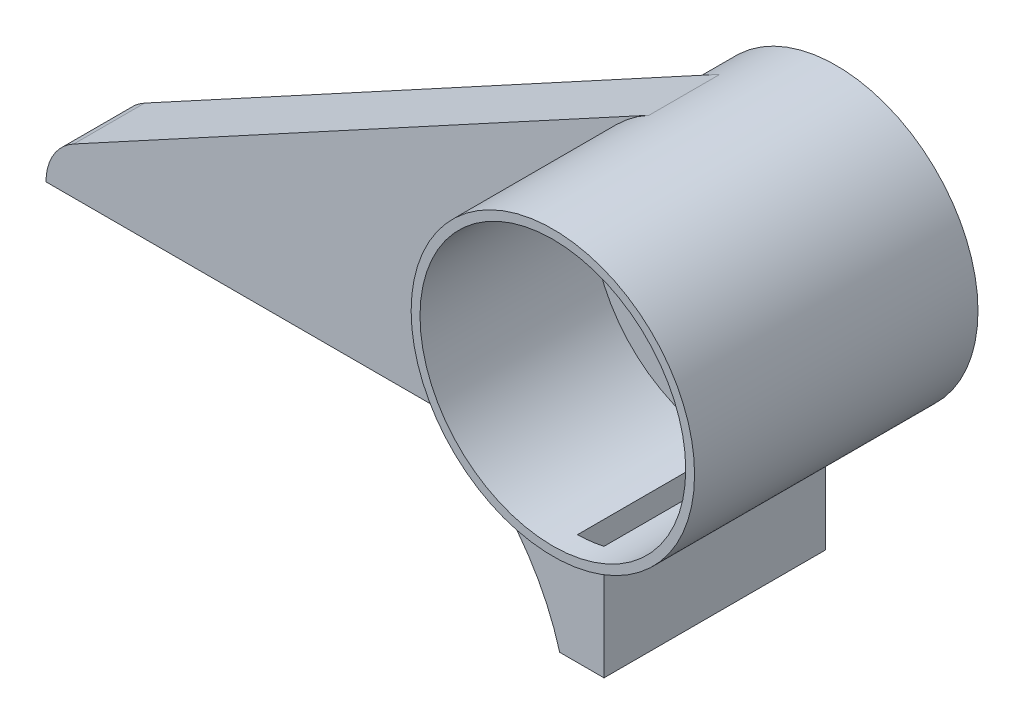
ISO-10303-21;
HEADER;
FILE_DESCRIPTION(('STEP AP214'),'2;1');
FILE_NAME('part.step','',(''),(''),'','','');
FILE_SCHEMA(('AUTOMOTIVE_DESIGN { 1 0 10303 214 1 1 1 1 }'));
ENDSEC;
DATA;
#1=APPLICATION_CONTEXT('core data for automotive mechanical design processes');
#2=APPLICATION_PROTOCOL_DEFINITION('international standard','automotive_design',2000,#1);
#3=PRODUCT_CONTEXT('',#1,'mechanical');
#4=PRODUCT('Part','Part','',(#3));
#5=PRODUCT_RELATED_PRODUCT_CATEGORY('part','',(#4));
#6=PRODUCT_DEFINITION_FORMATION('','',#4);
#7=PRODUCT_DEFINITION_CONTEXT('part definition',#1,'design');
#8=PRODUCT_DEFINITION('design','',#6,#7);
#9=PRODUCT_DEFINITION_SHAPE('','',#8);
#10=(LENGTH_UNIT() NAMED_UNIT(*) SI_UNIT(.MILLI.,.METRE.));
#11=(NAMED_UNIT(*) PLANE_ANGLE_UNIT() SI_UNIT($,.RADIAN.));
#12=(NAMED_UNIT(*) SI_UNIT($,.STERADIAN.) SOLID_ANGLE_UNIT());
#13=UNCERTAINTY_MEASURE_WITH_UNIT(LENGTH_MEASURE(1.E-05),#10,'distance_accuracy_value','');
#14=(GEOMETRIC_REPRESENTATION_CONTEXT(3) GLOBAL_UNCERTAINTY_ASSIGNED_CONTEXT((#13)) GLOBAL_UNIT_ASSIGNED_CONTEXT((#10,
#11,#12)) REPRESENTATION_CONTEXT('',''));
#15=CARTESIAN_POINT('',(0.,0.,0.));
#16=DIRECTION('',(0.,0.,1.));
#17=DIRECTION('',(1.,0.,0.));
#18=AXIS2_PLACEMENT_3D('',#15,#16,#17);
#19=CARTESIAN_POINT('',(151.451853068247,75.,-73.));
#20=DIRECTION('',(0.,0.,-1.));
#21=DIRECTION('',(-1.,0.,0.));
#22=AXIS2_PLACEMENT_3D('',#19,#20,#21);
#23=PLANE('',#22);
#24=DIRECTION('',(-1.,0.,0.));
#25=VECTOR('',#24,1.);
#26=CARTESIAN_POINT('',(160.,22.,-73.));
#27=LINE('',#26,#25);
#28=CARTESIAN_POINT('',(150.,22.,-73.));
#29=VERTEX_POINT('',#28);
#30=CARTESIAN_POINT('',(0.,22.,-73.));
#31=VERTEX_POINT('',#30);
#32=EDGE_CURVE('E232',#29,#31,#27,.T.);
#33=ORIENTED_EDGE('',*,*,#32,.F.);
#34=CARTESIAN_POINT('',(97.0560874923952,7.10227774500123,-73.));
#35=DIRECTION('',(0.,0.,-1.));
#36=DIRECTION('',(-1.,0.,0.));
#37=AXIS2_PLACEMENT_3D('',#34,#35,#36);
#38=CIRCLE('',#37,55.);
#39=CARTESIAN_POINT('',(131.44421515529,50.0261251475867,-73.));
#40=VERTEX_POINT('',#39);
#41=EDGE_CURVE('E54',#29,#40,#38,.F.);
#42=ORIENTED_EDGE('',*,*,#41,.T.);
#43=CARTESIAN_POINT('',(151.451853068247,75.,-73.));
#44=DIRECTION('',(0.,0.,-1.));
#45=DIRECTION('',(-1.,0.,0.));
#46=AXIS2_PLACEMENT_3D('',#43,#44,#45);
#47=CIRCLE('',#46,32.);
#48=CARTESIAN_POINT('',(136.175804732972,103.118363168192,-73.));
#49=VERTEX_POINT('',#48);
#50=EDGE_CURVE('E220',#40,#49,#47,.T.);
#51=ORIENTED_EDGE('',*,*,#50,.T.);
#52=DIRECTION('',(0.878698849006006,0.477376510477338,0.));
#53=VECTOR('',#52,1.);
#54=CARTESIAN_POINT('',(6.27148187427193,32.5443861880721,-73.));
#55=LINE('',#54,#53);
#56=CARTESIAN_POINT('',(6.27148187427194,32.5443861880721,-73.));
#57=VERTEX_POINT('',#56);
#58=EDGE_CURVE('E225',#57,#49,#55,.T.);
#59=ORIENTED_EDGE('',*,*,#58,.F.);
#60=CARTESIAN_POINT('',(12.,22.,-73.));
#61=DIRECTION('',(0.,0.,-1.));
#62=DIRECTION('',(-1.,0.,0.));
#63=AXIS2_PLACEMENT_3D('',#60,#61,#62);
#64=CIRCLE('',#63,12.);
#65=EDGE_CURVE('E228',#31,#57,#64,.T.);
#66=ORIENTED_EDGE('',*,*,#65,.F.);
#67=EDGE_LOOP('',(#33,#42,#51,#59,#66));
#68=FACE_BOUND('',#67,.T.);
#69=ADVANCED_FACE('F32',(#68),#23,.F.);
#70=CARTESIAN_POINT('',(160.,22.,-73.));
#71=DIRECTION('',(-1.,0.,0.));
#72=DIRECTION('',(0.,-1.,0.));
#73=AXIS2_PLACEMENT_3D('',#70,#71,#72);
#74=PLANE('',#73);
#75=DIRECTION('',(0.,1.,0.));
#76=VECTOR('',#75,1.);
#77=CARTESIAN_POINT('',(160.,22.,-89.));
#78=LINE('',#77,#76);
#79=CARTESIAN_POINT('',(160.,22.,-89.));
#80=VERTEX_POINT('',#79);
#81=CARTESIAN_POINT('',(160.,44.1628603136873,-89.));
#82=VERTEX_POINT('',#81);
#83=EDGE_CURVE('E224',#80,#82,#78,.T.);
#84=ORIENTED_EDGE('',*,*,#83,.T.);
#85=DIRECTION('',(0.,0.,-1.));
#86=VECTOR('',#85,1.);
#87=CARTESIAN_POINT('',(160.,44.1628603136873,-73.));
#88=LINE('',#87,#86);
#89=CARTESIAN_POINT('',(160.,44.1628603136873,-39.));
#90=VERTEX_POINT('',#89);
#91=EDGE_CURVE('E252',#90,#82,#88,.T.);
#92=ORIENTED_EDGE('',*,*,#91,.F.);
#93=DIRECTION('',(0.,-1.,0.));
#94=VECTOR('',#93,1.);
#95=CARTESIAN_POINT('',(160.,107.001,-39.));
#96=LINE('',#95,#94);
#97=CARTESIAN_POINT('',(160.,22.,-39.));
#98=VERTEX_POINT('',#97);
#99=EDGE_CURVE('E180',#90,#98,#96,.T.);
#100=ORIENTED_EDGE('',*,*,#99,.T.);
#101=DIRECTION('',(0.,0.,-1.));
#102=VECTOR('',#101,1.);
#103=CARTESIAN_POINT('',(160.,22.,-73.));
#104=LINE('',#103,#102);
#105=EDGE_CURVE('E234',#98,#80,#104,.T.);
#106=ORIENTED_EDGE('',*,*,#105,.T.);
#107=EDGE_LOOP('',(#84,#92,#100,#106));
#108=FACE_BOUND('',#107,.T.);
#109=ADVANCED_FACE('F273',(#108),#74,.F.);
#110=CARTESIAN_POINT('',(151.451853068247,75.,-73.));
#111=DIRECTION('',(0.,0.,-1.));
#112=DIRECTION('',(-1.,0.,0.));
#113=AXIS2_PLACEMENT_3D('',#110,#111,#112);
#114=CYLINDRICAL_SURFACE('',#113,32.);
#115=ORIENTED_EDGE('',*,*,#50,.F.);
#116=DIRECTION('',(0.,0.,-1.));
#117=VECTOR('',#116,1.);
#118=CARTESIAN_POINT('',(131.44421515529,50.0261251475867,-73.));
#119=LINE('',#118,#117);
#120=CARTESIAN_POINT('',(131.44421515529,50.0261251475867,-39.));
#121=VERTEX_POINT('',#120);
#122=EDGE_CURVE('E40',#40,#121,#119,.F.);
#123=ORIENTED_EDGE('',*,*,#122,.T.);
#124=CARTESIAN_POINT('',(151.451853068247,75.,-39.));
#125=DIRECTION('',(0.,0.,1.));
#126=DIRECTION('',(1.,0.,0.));
#127=AXIS2_PLACEMENT_3D('',#124,#125,#126);
#128=CIRCLE('',#127,32.);
#129=EDGE_CURVE('E46',#121,#90,#128,.T.);
#130=ORIENTED_EDGE('',*,*,#129,.T.);
#131=ORIENTED_EDGE('',*,*,#91,.T.);
#132=CARTESIAN_POINT('',(151.451853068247,75.,-89.));
#133=DIRECTION('',(0.,0.,-1.));
#134=DIRECTION('',(-1.,0.,0.));
#135=AXIS2_PLACEMENT_3D('',#132,#133,#134);
#136=CIRCLE('',#135,32.);
#137=CARTESIAN_POINT('',(136.175804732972,103.118363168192,-89.));
#138=VERTEX_POINT('',#137);
#139=EDGE_CURVE('E255',#82,#138,#136,.T.);
#140=ORIENTED_EDGE('',*,*,#139,.T.);
#141=DIRECTION('',(0.,0.,-1.));
#142=VECTOR('',#141,1.);
#143=CARTESIAN_POINT('',(136.175804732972,103.118363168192,-73.));
#144=LINE('',#143,#142);
#145=EDGE_CURVE('E249',#49,#138,#144,.T.);
#146=ORIENTED_EDGE('',*,*,#145,.F.);
#147=EDGE_LOOP('',(#115,#123,#130,#131,#140,#146));
#148=FACE_BOUND('',#147,.T.);
#149=CARTESIAN_POINT('',(151.451853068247,75.,-100.));
#150=DIRECTION('',(0.,0.,-1.));
#151=DIRECTION('',(-1.,0.,0.));
#152=AXIS2_PLACEMENT_3D('',#149,#150,#151);
#153=CIRCLE('',#152,32.);
#154=CARTESIAN_POINT('',(119.451853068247,75.,-100.));
#155=VERTEX_POINT('',#154);
#156=EDGE_CURVE('E216',#155,#155,#153,.T.);
#157=ORIENTED_EDGE('',*,*,#156,.F.);
#158=EDGE_LOOP('',(#157));
#159=FACE_BOUND('',#158,.T.);
#160=CARTESIAN_POINT('',(151.451853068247,75.,-36.));
#161=DIRECTION('',(0.,0.,-1.));
#162=DIRECTION('',(-1.,0.,0.));
#163=AXIS2_PLACEMENT_3D('',#160,#161,#162);
#164=CIRCLE('',#163,32.);
#165=CARTESIAN_POINT('',(119.451853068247,75.,-36.));
#166=VERTEX_POINT('',#165);
#167=EDGE_CURVE('E217',#166,#166,#164,.T.);
#168=ORIENTED_EDGE('',*,*,#167,.T.);
#169=EDGE_LOOP('',(#168));
#170=FACE_BOUND('',#169,.T.);
#171=ADVANCED_FACE('F261',(#148,#159,#170),#114,.T.);
#172=CARTESIAN_POINT('',(6.27148187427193,32.5443861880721,-73.));
#173=DIRECTION('',(-0.477376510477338,0.878698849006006,0.));
#174=DIRECTION('',(-0.878698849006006,-0.477376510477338,0.));
#175=AXIS2_PLACEMENT_3D('',#172,#173,#174);
#176=PLANE('',#175);
#177=DIRECTION('',(0.878698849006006,0.477376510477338,0.));
#178=VECTOR('',#177,1.);
#179=CARTESIAN_POINT('',(6.27148187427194,32.5443861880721,-89.));
#180=LINE('',#179,#178);
#181=CARTESIAN_POINT('',(6.27148187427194,32.5443861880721,-89.));
#182=VERTEX_POINT('',#181);
#183=EDGE_CURVE('E237',#182,#138,#180,.T.);
#184=ORIENTED_EDGE('',*,*,#183,.F.);
#185=DIRECTION('',(0.,0.,-1.));
#186=VECTOR('',#185,1.);
#187=CARTESIAN_POINT('',(6.27148187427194,32.5443861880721,-73.));
#188=LINE('',#187,#186);
#189=EDGE_CURVE('E247',#57,#182,#188,.T.);
#190=ORIENTED_EDGE('',*,*,#189,.F.);
#191=ORIENTED_EDGE('',*,*,#58,.T.);
#192=ORIENTED_EDGE('',*,*,#145,.T.);
#193=EDGE_LOOP('',(#184,#190,#191,#192));
#194=FACE_BOUND('',#193,.T.);
#195=ADVANCED_FACE('F279',(#194),#176,.T.);
#196=CARTESIAN_POINT('',(12.,22.,-73.));
#197=DIRECTION('',(0.,0.,-1.));
#198=DIRECTION('',(-1.,0.,0.));
#199=AXIS2_PLACEMENT_3D('',#196,#197,#198);
#200=CYLINDRICAL_SURFACE('',#199,12.);
#201=CARTESIAN_POINT('',(12.,22.,-89.));
#202=DIRECTION('',(0.,0.,-1.));
#203=DIRECTION('',(-1.,0.,0.));
#204=AXIS2_PLACEMENT_3D('',#201,#202,#203);
#205=CIRCLE('',#204,12.);
#206=CARTESIAN_POINT('',(0.,22.,-89.));
#207=VERTEX_POINT('',#206);
#208=EDGE_CURVE('E239',#207,#182,#205,.T.);
#209=ORIENTED_EDGE('',*,*,#208,.F.);
#210=DIRECTION('',(0.,0.,-1.));
#211=VECTOR('',#210,1.);
#212=CARTESIAN_POINT('',(0.,22.,-73.));
#213=LINE('',#212,#211);
#214=EDGE_CURVE('E245',#31,#207,#213,.T.);
#215=ORIENTED_EDGE('',*,*,#214,.F.);
#216=ORIENTED_EDGE('',*,*,#65,.T.);
#217=ORIENTED_EDGE('',*,*,#189,.T.);
#218=EDGE_LOOP('',(#209,#215,#216,#217));
#219=FACE_BOUND('',#218,.T.);
#220=ADVANCED_FACE('F284',(#219),#200,.T.);
#221=CARTESIAN_POINT('',(160.,22.,-73.));
#222=DIRECTION('',(0.,-1.,0.));
#223=DIRECTION('',(0.,0.,-1.));
#224=AXIS2_PLACEMENT_3D('',#221,#222,#223);
#225=PLANE('',#224);
#226=DIRECTION('',(-1.,0.,0.));
#227=VECTOR('',#226,1.);
#228=CARTESIAN_POINT('',(160.,22.,-89.));
#229=LINE('',#228,#227);
#230=EDGE_CURVE('E229',#80,#207,#229,.T.);
#231=ORIENTED_EDGE('',*,*,#230,.F.);
#232=ORIENTED_EDGE('',*,*,#105,.F.);
#233=DIRECTION('',(-1.,0.,0.));
#234=VECTOR('',#233,1.);
#235=CARTESIAN_POINT('',(160.,22.,-39.));
#236=LINE('',#235,#234);
#237=CARTESIAN_POINT('',(150.,22.,-39.));
#238=VERTEX_POINT('',#237);
#239=EDGE_CURVE('E210',#98,#238,#236,.T.);
#240=ORIENTED_EDGE('',*,*,#239,.T.);
#241=DIRECTION('',(0.,0.,1.));
#242=VECTOR('',#241,1.);
#243=CARTESIAN_POINT('',(150.,22.,-73.));
#244=LINE('',#243,#242);
#245=EDGE_CURVE('E207',#29,#238,#244,.T.);
#246=ORIENTED_EDGE('',*,*,#245,.F.);
#247=ORIENTED_EDGE('',*,*,#32,.T.);
#248=ORIENTED_EDGE('',*,*,#214,.T.);
#249=EDGE_LOOP('',(#231,#232,#240,#246,#247,#248));
#250=FACE_BOUND('',#249,.T.);
#251=ADVANCED_FACE('F270',(#250),#225,.T.);
#252=CARTESIAN_POINT('',(151.451853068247,75.,-89.));
#253=DIRECTION('',(0.,0.,-1.));
#254=DIRECTION('',(-1.,0.,0.));
#255=AXIS2_PLACEMENT_3D('',#252,#253,#254);
#256=PLANE('',#255);
#257=ORIENTED_EDGE('',*,*,#139,.F.);
#258=ORIENTED_EDGE('',*,*,#83,.F.);
#259=ORIENTED_EDGE('',*,*,#230,.T.);
#260=ORIENTED_EDGE('',*,*,#208,.T.);
#261=ORIENTED_EDGE('',*,*,#183,.T.);
#262=EDGE_LOOP('',(#257,#258,#259,#260,#261));
#263=FACE_BOUND('',#262,.T.);
#264=ADVANCED_FACE('F275',(#263),#256,.T.);
#265=CARTESIAN_POINT('',(151.451853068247,75.,-100.));
#266=DIRECTION('',(0.,0.,-1.));
#267=DIRECTION('',(-1.,0.,0.));
#268=AXIS2_PLACEMENT_3D('',#265,#266,#267);
#269=PLANE('',#268);
#270=CARTESIAN_POINT('',(151.451853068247,75.,-100.));
#271=DIRECTION('',(0.,0.,-1.));
#272=DIRECTION('',(-1.,0.,0.));
#273=AXIS2_PLACEMENT_3D('',#270,#271,#272);
#274=CIRCLE('',#273,30.);
#275=CARTESIAN_POINT('',(121.451853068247,75.,-100.));
#276=VERTEX_POINT('',#275);
#277=EDGE_CURVE('E175',#276,#276,#274,.T.);
#278=ORIENTED_EDGE('',*,*,#277,.F.);
#279=EDGE_LOOP('',(#278));
#280=FACE_BOUND('',#279,.T.);
#281=ORIENTED_EDGE('',*,*,#156,.T.);
#282=EDGE_LOOP('',(#281));
#283=FACE_BOUND('',#282,.T.);
#284=ADVANCED_FACE('F300',(#280,#283),#269,.T.);
#285=CARTESIAN_POINT('',(151.451853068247,75.,-36.));
#286=DIRECTION('',(0.,0.,-1.));
#287=DIRECTION('',(-1.,0.,0.));
#288=AXIS2_PLACEMENT_3D('',#285,#286,#287);
#289=PLANE('',#288);
#290=CARTESIAN_POINT('',(151.451853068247,75.,-36.));
#291=DIRECTION('',(0.,0.,-1.));
#292=DIRECTION('',(-1.,0.,0.));
#293=AXIS2_PLACEMENT_3D('',#290,#291,#292);
#294=CIRCLE('',#293,30.);
#295=CARTESIAN_POINT('',(121.451853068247,75.,-36.));
#296=VERTEX_POINT('',#295);
#297=EDGE_CURVE('E146',#296,#296,#294,.T.);
#298=ORIENTED_EDGE('',*,*,#297,.T.);
#299=EDGE_LOOP('',(#298));
#300=FACE_BOUND('',#299,.T.);
#301=ORIENTED_EDGE('',*,*,#167,.F.);
#302=EDGE_LOOP('',(#301));
#303=FACE_BOUND('',#302,.T.);
#304=ADVANCED_FACE('F306',(#300,#303),#289,.F.);
#305=CARTESIAN_POINT('',(160.,107.001,-39.));
#306=DIRECTION('',(0.,0.,1.));
#307=DIRECTION('',(1.,0.,0.));
#308=AXIS2_PLACEMENT_3D('',#305,#306,#307);
#309=PLANE('',#308);
#310=ORIENTED_EDGE('',*,*,#129,.F.);
#311=CARTESIAN_POINT('',(97.0560874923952,7.10227774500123,-39.));
#312=DIRECTION('',(0.,0.,1.));
#313=DIRECTION('',(1.,0.,0.));
#314=AXIS2_PLACEMENT_3D('',#311,#312,#313);
#315=CIRCLE('',#314,55.);
#316=EDGE_CURVE('E11',#121,#238,#315,.F.);
#317=ORIENTED_EDGE('',*,*,#316,.T.);
#318=ORIENTED_EDGE('',*,*,#239,.F.);
#319=ORIENTED_EDGE('',*,*,#99,.F.);
#320=EDGE_LOOP('',(#310,#317,#318,#319));
#321=FACE_BOUND('',#320,.T.);
#322=ADVANCED_FACE('F267',(#321),#309,.T.);
#323=CARTESIAN_POINT('',(151.451853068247,75.,-75.));
#324=DIRECTION('',(0.,0.,-1.));
#325=DIRECTION('',(-1.,0.,0.));
#326=AXIS2_PLACEMENT_3D('',#323,#324,#325);
#327=PLANE('',#326);
#328=DIRECTION('',(0.,-1.,0.));
#329=VECTOR('',#328,1.);
#330=CARTESIAN_POINT('',(152.,75.,-75.));
#331=LINE('',#330,#329);
#332=CARTESIAN_POINT('',(152.,45.0050081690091,-75.));
#333=VERTEX_POINT('',#332);
#334=CARTESIAN_POINT('',(152.,24.,-75.));
#335=VERTEX_POINT('',#334);
#336=EDGE_CURVE('E183',#333,#335,#331,.T.);
#337=ORIENTED_EDGE('',*,*,#336,.T.);
#338=DIRECTION('',(-1.,0.,0.));
#339=VECTOR('',#338,1.);
#340=CARTESIAN_POINT('',(151.451853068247,24.,-75.));
#341=LINE('',#340,#339);
#342=CARTESIAN_POINT('',(2.20204102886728,24.,-75.));
#343=VERTEX_POINT('',#342);
#344=EDGE_CURVE('E163',#335,#343,#341,.T.);
#345=ORIENTED_EDGE('',*,*,#344,.T.);
#346=CARTESIAN_POINT('',(12.,22.,-75.));
#347=DIRECTION('',(0.,0.,-1.));
#348=DIRECTION('',(-1.,0.,0.));
#349=AXIS2_PLACEMENT_3D('',#346,#347,#348);
#350=CIRCLE('',#349,10.);
#351=CARTESIAN_POINT('',(7.22623489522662,30.7869884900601,-75.));
#352=VERTEX_POINT('',#351);
#353=EDGE_CURVE('E160',#343,#352,#350,.T.);
#354=ORIENTED_EDGE('',*,*,#353,.T.);
#355=DIRECTION('',(0.878698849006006,0.477376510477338,0.));
#356=VECTOR('',#355,1.);
#357=CARTESIAN_POINT('',(137.130557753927,101.36096547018,-75.));
#358=LINE('',#357,#356);
#359=CARTESIAN_POINT('',(137.130557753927,101.36096547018,-75.));
#360=VERTEX_POINT('',#359);
#361=EDGE_CURVE('E151',#352,#360,#358,.T.);
#362=ORIENTED_EDGE('',*,*,#361,.T.);
#363=CARTESIAN_POINT('',(151.451853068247,75.,-75.));
#364=DIRECTION('',(0.,0.,-1.));
#365=DIRECTION('',(-1.,0.,0.));
#366=AXIS2_PLACEMENT_3D('',#363,#364,#365);
#367=CIRCLE('',#366,30.);
#368=EDGE_CURVE('E133',#333,#360,#367,.T.);
#369=ORIENTED_EDGE('',*,*,#368,.F.);
#370=EDGE_LOOP('',(#337,#345,#354,#362,#369));
#371=FACE_BOUND('',#370,.T.);
#372=ADVANCED_FACE('F158',(#371),#327,.T.);
#373=CARTESIAN_POINT('',(158.,22.,-73.));
#374=DIRECTION('',(-1.,0.,0.));
#375=DIRECTION('',(0.,-1.,0.));
#376=AXIS2_PLACEMENT_3D('',#373,#374,#375);
#377=PLANE('',#376);
#378=DIRECTION('',(0.,1.,0.));
#379=VECTOR('',#378,1.);
#380=CARTESIAN_POINT('',(158.,75.,-87.));
#381=LINE('',#380,#379);
#382=CARTESIAN_POINT('',(158.,24.,-87.));
#383=VERTEX_POINT('',#382);
#384=CARTESIAN_POINT('',(158.,45.7233579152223,-87.));
#385=VERTEX_POINT('',#384);
#386=EDGE_CURVE('E145',#383,#385,#381,.T.);
#387=ORIENTED_EDGE('',*,*,#386,.F.);
#388=DIRECTION('',(0.,0.,-1.));
#389=VECTOR('',#388,1.);
#390=CARTESIAN_POINT('',(158.,24.,-73.));
#391=LINE('',#390,#389);
#392=CARTESIAN_POINT('',(158.,24.,-41.));
#393=VERTEX_POINT('',#392);
#394=EDGE_CURVE('E171',#393,#383,#391,.T.);
#395=ORIENTED_EDGE('',*,*,#394,.F.);
#396=DIRECTION('',(0.,-1.,0.));
#397=VECTOR('',#396,1.);
#398=CARTESIAN_POINT('',(158.,107.001,-41.));
#399=LINE('',#398,#397);
#400=CARTESIAN_POINT('',(158.,45.7233579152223,-41.));
#401=VERTEX_POINT('',#400);
#402=EDGE_CURVE('E184',#401,#393,#399,.T.);
#403=ORIENTED_EDGE('',*,*,#402,.F.);
#404=DIRECTION('',(0.,0.,-1.));
#405=VECTOR('',#404,1.);
#406=CARTESIAN_POINT('',(158.,45.7233579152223,-41.));
#407=LINE('',#406,#405);
#408=EDGE_CURVE('E155',#401,#385,#407,.T.);
#409=ORIENTED_EDGE('',*,*,#408,.T.);
#410=EDGE_LOOP('',(#387,#395,#403,#409));
#411=FACE_BOUND('',#410,.T.);
#412=ADVANCED_FACE('F364',(#411),#377,.T.);
#413=CARTESIAN_POINT('',(151.451853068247,75.,-73.));
#414=DIRECTION('',(0.,0.,-1.));
#415=DIRECTION('',(-1.,0.,0.));
#416=AXIS2_PLACEMENT_3D('',#413,#414,#415);
#417=CYLINDRICAL_SURFACE('',#416,30.);
#418=CARTESIAN_POINT('',(151.451853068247,75.,-41.));
#419=DIRECTION('',(0.,0.,1.));
#420=DIRECTION('',(1.,0.,0.));
#421=AXIS2_PLACEMENT_3D('',#418,#419,#420);
#422=CIRCLE('',#421,30.);
#423=CARTESIAN_POINT('',(152.,45.0050081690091,-41.));
#424=VERTEX_POINT('',#423);
#425=EDGE_CURVE('E172',#424,#401,#422,.T.);
#426=ORIENTED_EDGE('',*,*,#425,.F.);
#427=DIRECTION('',(0.,0.,-1.));
#428=VECTOR('',#427,1.);
#429=CARTESIAN_POINT('',(152.,45.0050081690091,-41.));
#430=LINE('',#429,#428);
#431=EDGE_CURVE('E140',#424,#333,#430,.T.);
#432=ORIENTED_EDGE('',*,*,#431,.T.);
#433=ORIENTED_EDGE('',*,*,#368,.T.);
#434=DIRECTION('',(0.,0.,1.));
#435=VECTOR('',#434,1.);
#436=CARTESIAN_POINT('',(137.130557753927,101.36096547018,-73.));
#437=LINE('',#436,#435);
#438=CARTESIAN_POINT('',(137.130557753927,101.36096547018,-87.));
#439=VERTEX_POINT('',#438);
#440=EDGE_CURVE('E137',#360,#439,#437,.F.);
#441=ORIENTED_EDGE('',*,*,#440,.T.);
#442=CARTESIAN_POINT('',(151.451853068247,75.,-87.));
#443=DIRECTION('',(0.,0.,-1.));
#444=DIRECTION('',(-1.,0.,0.));
#445=AXIS2_PLACEMENT_3D('',#442,#443,#444);
#446=CIRCLE('',#445,30.);
#447=EDGE_CURVE('E179',#385,#439,#446,.T.);
#448=ORIENTED_EDGE('',*,*,#447,.F.);
#449=ORIENTED_EDGE('',*,*,#408,.F.);
#450=EDGE_LOOP('',(#426,#432,#433,#441,#448,#449));
#451=FACE_BOUND('',#450,.T.);
#452=ORIENTED_EDGE('',*,*,#277,.T.);
#453=EDGE_LOOP('',(#452));
#454=FACE_BOUND('',#453,.T.);
#455=ORIENTED_EDGE('',*,*,#297,.F.);
#456=EDGE_LOOP('',(#455));
#457=FACE_BOUND('',#456,.T.);
#458=ADVANCED_FACE('F135',(#451,#454,#457),#417,.F.);
#459=CARTESIAN_POINT('',(7.22623489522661,30.7869884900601,-73.));
#460=DIRECTION('',(-0.477376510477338,0.878698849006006,0.));
#461=DIRECTION('',(-0.878698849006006,-0.477376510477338,0.));
#462=AXIS2_PLACEMENT_3D('',#459,#460,#461);
#463=PLANE('',#462);
#464=DIRECTION('',(0.878698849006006,0.477376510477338,0.));
#465=VECTOR('',#464,1.);
#466=CARTESIAN_POINT('',(137.130557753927,101.36096547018,-87.));
#467=LINE('',#466,#465);
#468=CARTESIAN_POINT('',(7.22623489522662,30.7869884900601,-87.));
#469=VERTEX_POINT('',#468);
#470=EDGE_CURVE('E154',#469,#439,#467,.T.);
#471=ORIENTED_EDGE('',*,*,#470,.T.);
#472=ORIENTED_EDGE('',*,*,#440,.F.);
#473=ORIENTED_EDGE('',*,*,#361,.F.);
#474=DIRECTION('',(0.,0.,-1.));
#475=VECTOR('',#474,1.);
#476=CARTESIAN_POINT('',(7.22623489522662,30.7869884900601,-73.));
#477=LINE('',#476,#475);
#478=EDGE_CURVE('E156',#352,#469,#477,.T.);
#479=ORIENTED_EDGE('',*,*,#478,.T.);
#480=EDGE_LOOP('',(#471,#472,#473,#479));
#481=FACE_BOUND('',#480,.T.);
#482=ADVANCED_FACE('F150',(#481),#463,.F.);
#483=CARTESIAN_POINT('',(12.,22.,-73.));
#484=DIRECTION('',(0.,0.,-1.));
#485=DIRECTION('',(-1.,0.,0.));
#486=AXIS2_PLACEMENT_3D('',#483,#484,#485);
#487=CYLINDRICAL_SURFACE('',#486,10.);
#488=CARTESIAN_POINT('',(12.,22.,-87.));
#489=DIRECTION('',(0.,0.,-1.));
#490=DIRECTION('',(-1.,0.,0.));
#491=AXIS2_PLACEMENT_3D('',#488,#489,#490);
#492=CIRCLE('',#491,10.);
#493=CARTESIAN_POINT('',(2.20204102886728,24.,-87.));
#494=VERTEX_POINT('',#493);
#495=EDGE_CURVE('E166',#494,#469,#492,.T.);
#496=ORIENTED_EDGE('',*,*,#495,.T.);
#497=ORIENTED_EDGE('',*,*,#478,.F.);
#498=ORIENTED_EDGE('',*,*,#353,.F.);
#499=DIRECTION('',(0.,0.,-1.));
#500=VECTOR('',#499,1.);
#501=CARTESIAN_POINT('',(2.20204102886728,24.,-75.));
#502=LINE('',#501,#500);
#503=EDGE_CURVE('E189',#343,#494,#502,.T.);
#504=ORIENTED_EDGE('',*,*,#503,.T.);
#505=EDGE_LOOP('',(#496,#497,#498,#504));
#506=FACE_BOUND('',#505,.T.);
#507=ADVANCED_FACE('F393',(#506),#487,.F.);
#508=CARTESIAN_POINT('',(160.,24.,-73.));
#509=DIRECTION('',(0.,-1.,0.));
#510=DIRECTION('',(0.,0.,-1.));
#511=AXIS2_PLACEMENT_3D('',#508,#509,#510);
#512=PLANE('',#511);
#513=DIRECTION('',(-1.,0.,0.));
#514=VECTOR('',#513,1.);
#515=CARTESIAN_POINT('',(151.451853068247,24.,-87.));
#516=LINE('',#515,#514);
#517=EDGE_CURVE('E161',#383,#494,#516,.T.);
#518=ORIENTED_EDGE('',*,*,#517,.T.);
#519=ORIENTED_EDGE('',*,*,#503,.F.);
#520=ORIENTED_EDGE('',*,*,#344,.F.);
#521=DIRECTION('',(0.,0.,1.));
#522=VECTOR('',#521,1.);
#523=CARTESIAN_POINT('',(152.,24.,-73.));
#524=LINE('',#523,#522);
#525=CARTESIAN_POINT('',(152.,24.,-41.));
#526=VERTEX_POINT('',#525);
#527=EDGE_CURVE('E194',#335,#526,#524,.T.);
#528=ORIENTED_EDGE('',*,*,#527,.T.);
#529=DIRECTION('',(-1.,0.,0.));
#530=VECTOR('',#529,1.);
#531=CARTESIAN_POINT('',(160.,24.,-41.));
#532=LINE('',#531,#530);
#533=EDGE_CURVE('E176',#393,#526,#532,.T.);
#534=ORIENTED_EDGE('',*,*,#533,.F.);
#535=ORIENTED_EDGE('',*,*,#394,.T.);
#536=EDGE_LOOP('',(#518,#519,#520,#528,#534,#535));
#537=FACE_BOUND('',#536,.T.);
#538=ADVANCED_FACE('F402',(#537),#512,.F.);
#539=CARTESIAN_POINT('',(151.451853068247,75.,-87.));
#540=DIRECTION('',(0.,0.,-1.));
#541=DIRECTION('',(-1.,0.,0.));
#542=AXIS2_PLACEMENT_3D('',#539,#540,#541);
#543=PLANE('',#542);
#544=ORIENTED_EDGE('',*,*,#447,.T.);
#545=ORIENTED_EDGE('',*,*,#470,.F.);
#546=ORIENTED_EDGE('',*,*,#495,.F.);
#547=ORIENTED_EDGE('',*,*,#517,.F.);
#548=ORIENTED_EDGE('',*,*,#386,.T.);
#549=EDGE_LOOP('',(#544,#545,#546,#547,#548));
#550=FACE_BOUND('',#549,.T.);
#551=ADVANCED_FACE('F413',(#550),#543,.F.);
#552=CARTESIAN_POINT('',(152.,107.001,-73.));
#553=DIRECTION('',(1.,0.,0.));
#554=DIRECTION('',(0.,0.,-1.));
#555=AXIS2_PLACEMENT_3D('',#552,#553,#554);
#556=PLANE('',#555);
#557=DIRECTION('',(0.,-1.,0.));
#558=VECTOR('',#557,1.);
#559=CARTESIAN_POINT('',(152.,107.001,-41.));
#560=LINE('',#559,#558);
#561=EDGE_CURVE('E193',#424,#526,#560,.T.);
#562=ORIENTED_EDGE('',*,*,#561,.T.);
#563=ORIENTED_EDGE('',*,*,#527,.F.);
#564=ORIENTED_EDGE('',*,*,#336,.F.);
#565=ORIENTED_EDGE('',*,*,#431,.F.);
#566=EDGE_LOOP('',(#562,#563,#564,#565));
#567=FACE_BOUND('',#566,.T.);
#568=ADVANCED_FACE('F423',(#567),#556,.T.);
#569=CARTESIAN_POINT('',(160.,107.001,-41.));
#570=DIRECTION('',(0.,0.,1.));
#571=DIRECTION('',(1.,0.,0.));
#572=AXIS2_PLACEMENT_3D('',#569,#570,#571);
#573=PLANE('',#572);
#574=ORIENTED_EDGE('',*,*,#425,.T.);
#575=ORIENTED_EDGE('',*,*,#402,.T.);
#576=ORIENTED_EDGE('',*,*,#533,.T.);
#577=ORIENTED_EDGE('',*,*,#561,.F.);
#578=EDGE_LOOP('',(#574,#575,#576,#577));
#579=FACE_BOUND('',#578,.T.);
#580=ADVANCED_FACE('F433',(#579),#573,.F.);
#581=CARTESIAN_POINT('',(97.0560874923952,7.10227774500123,-73.));
#582=DIRECTION('',(0.,0.,1.));
#583=DIRECTION('',(1.,0.,0.));
#584=AXIS2_PLACEMENT_3D('',#581,#582,#583);
#585=CYLINDRICAL_SURFACE('',#584,55.);
#586=ORIENTED_EDGE('',*,*,#316,.F.);
#587=ORIENTED_EDGE('',*,*,#122,.F.);
#588=ORIENTED_EDGE('',*,*,#41,.F.);
#589=ORIENTED_EDGE('',*,*,#245,.T.);
#590=EDGE_LOOP('',(#586,#587,#588,#589));
#591=FACE_BOUND('',#590,.T.);
#592=ADVANCED_FACE('F34',(#591),#585,.F.);
#593=CLOSED_SHELL('',(#69,#109,#171,#195,#220,#251,#264,#284,#304,#322,#372,#412,#458,#482,#507,
#538,#551,#568,#580,#592));
#594=MANIFOLD_SOLID_BREP('B2',#593);
#595=ADVANCED_BREP_SHAPE_REPRESENTATION('',(#18,#594),#14);
#596=SHAPE_DEFINITION_REPRESENTATION(#9,#595);
ENDSEC;
END-ISO-10303-21;
